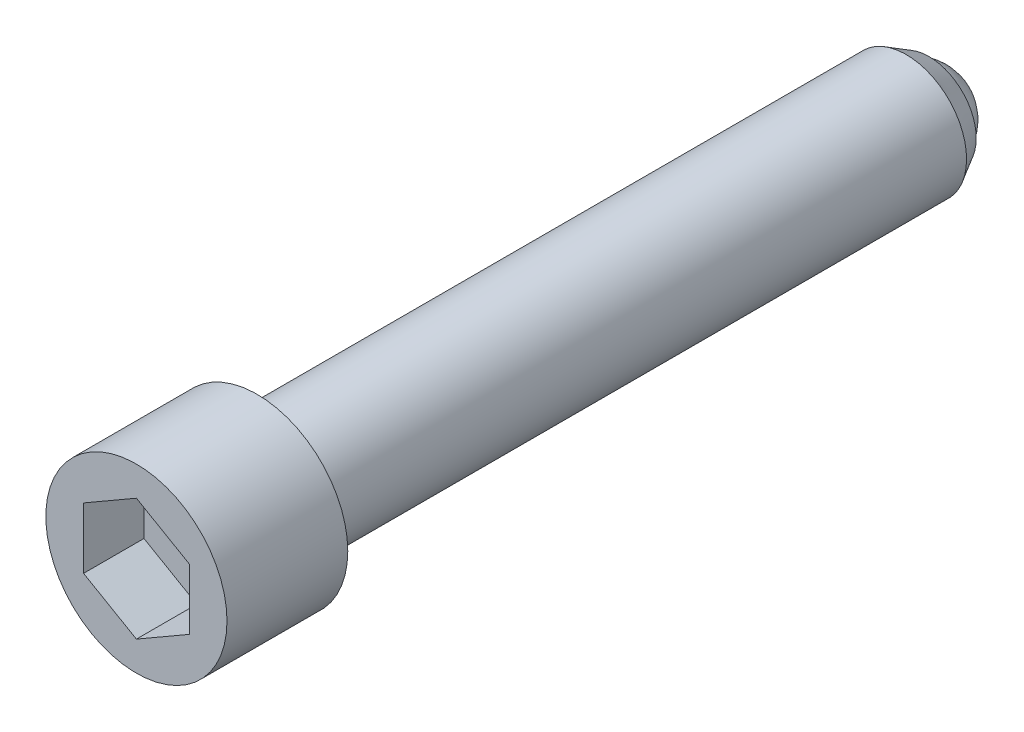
ISO-10303-21;
HEADER;
FILE_DESCRIPTION(('STEP AP214'),'2;1');
FILE_NAME('part.step','',(''),(''),'','','');
FILE_SCHEMA(('AUTOMOTIVE_DESIGN { 1 0 10303 214 1 1 1 1 }'));
ENDSEC;
DATA;
#1=APPLICATION_CONTEXT('core data for automotive mechanical design processes');
#2=APPLICATION_PROTOCOL_DEFINITION('international standard','automotive_design',2000,#1);
#3=PRODUCT_CONTEXT('',#1,'mechanical');
#4=PRODUCT('Part','Part','',(#3));
#5=PRODUCT_RELATED_PRODUCT_CATEGORY('part','',(#4));
#6=PRODUCT_DEFINITION_FORMATION('','',#4);
#7=PRODUCT_DEFINITION_CONTEXT('part definition',#1,'design');
#8=PRODUCT_DEFINITION('design','',#6,#7);
#9=PRODUCT_DEFINITION_SHAPE('','',#8);
#10=(LENGTH_UNIT() NAMED_UNIT(*) SI_UNIT(.MILLI.,.METRE.));
#11=(NAMED_UNIT(*) PLANE_ANGLE_UNIT() SI_UNIT($,.RADIAN.));
#12=(NAMED_UNIT(*) SI_UNIT($,.STERADIAN.) SOLID_ANGLE_UNIT());
#13=UNCERTAINTY_MEASURE_WITH_UNIT(LENGTH_MEASURE(1.E-05),#10,'distance_accuracy_value','');
#14=(GEOMETRIC_REPRESENTATION_CONTEXT(3) GLOBAL_UNCERTAINTY_ASSIGNED_CONTEXT((#13)) GLOBAL_UNIT_ASSIGNED_CONTEXT((#10,
#11,#12)) REPRESENTATION_CONTEXT('',''));
#15=CARTESIAN_POINT('',(0.,0.,0.));
#16=DIRECTION('',(0.,0.,1.));
#17=DIRECTION('',(1.,0.,0.));
#18=AXIS2_PLACEMENT_3D('',#15,#16,#17);
#19=CARTESIAN_POINT('',(0.,0.,6.));
#20=DIRECTION('',(0.,0.,-1.));
#21=DIRECTION('',(1.,0.,0.));
#22=AXIS2_PLACEMENT_3D('',#19,#20,#21);
#23=SPHERICAL_SURFACE('',#22,6.);
#24=CARTESIAN_POINT('',(0.,0.,4.));
#25=DIRECTION('',(0.,0.,-1.));
#26=DIRECTION('',(1.,0.,0.));
#27=AXIS2_PLACEMENT_3D('',#24,#25,#26);
#28=CIRCLE('',#27,5.65685424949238);
#29=CARTESIAN_POINT('',(5.65685424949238,0.,4.));
#30=VERTEX_POINT('',#29);
#31=EDGE_CURVE('E9',#30,#30,#28,.T.);
#32=ORIENTED_EDGE('',*,*,#31,.T.);
#33=EDGE_LOOP('',(#32));
#34=FACE_BOUND('',#33,.T.);
#35=ADVANCED_FACE('F15',(#34),#23,.T.);
#36=CARTESIAN_POINT('',(6.25,0.,4.));
#37=DIRECTION('',(0.,0.,1.));
#38=DIRECTION('',(-1.,0.,0.));
#39=AXIS2_PLACEMENT_3D('',#36,#37,#38);
#40=PLANE('',#39);
#41=ORIENTED_EDGE('',*,*,#31,.F.);
#42=EDGE_LOOP('',(#41));
#43=FACE_BOUND('',#42,.T.);
#44=CARTESIAN_POINT('',(0.,0.,4.));
#45=DIRECTION('',(0.,0.,-1.));
#46=DIRECTION('',(1.,0.,0.));
#47=AXIS2_PLACEMENT_3D('',#44,#45,#46);
#48=CIRCLE('',#47,6.25);
#49=CARTESIAN_POINT('',(6.25,0.,4.));
#50=VERTEX_POINT('',#49);
#51=EDGE_CURVE('E22',#50,#50,#48,.T.);
#52=ORIENTED_EDGE('',*,*,#51,.T.);
#53=EDGE_LOOP('',(#52));
#54=FACE_BOUND('',#53,.T.);
#55=ADVANCED_FACE('F136',(#43,#54),#40,.F.);
#56=CARTESIAN_POINT('',(0.,0.,4.));
#57=DIRECTION('',(0.,0.,1.));
#58=DIRECTION('',(-1.,0.,0.));
#59=AXIS2_PLACEMENT_3D('',#56,#57,#58);
#60=CONICAL_SURFACE('',#59,6.25,0.523598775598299);
#61=CARTESIAN_POINT('',(0.,0.,7.0310889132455));
#62=DIRECTION('',(0.,0.,-1.));
#63=DIRECTION('',(1.,0.,0.));
#64=AXIS2_PLACEMENT_3D('',#61,#62,#63);
#65=CIRCLE('',#64,8.);
#66=CARTESIAN_POINT('',(8.,0.,7.0310889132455));
#67=VERTEX_POINT('',#66);
#68=EDGE_CURVE('E131',#67,#67,#65,.T.);
#69=ORIENTED_EDGE('',*,*,#68,.T.);
#70=EDGE_LOOP('',(#69));
#71=FACE_BOUND('',#70,.T.);
#72=ORIENTED_EDGE('',*,*,#51,.F.);
#73=EDGE_LOOP('',(#72));
#74=FACE_BOUND('',#73,.T.);
#75=ADVANCED_FACE('F138',(#71,#74),#60,.T.);
#76=CARTESIAN_POINT('',(0.,0.,-17.));
#77=DIRECTION('',(0.,0.,-1.));
#78=DIRECTION('',(1.,0.,0.));
#79=AXIS2_PLACEMENT_3D('',#76,#77,#78);
#80=CYLINDRICAL_SURFACE('',#79,8.);
#81=CARTESIAN_POINT('',(0.,0.,93.));
#82=DIRECTION('',(0.,0.,-1.));
#83=DIRECTION('',(1.,0.,0.));
#84=AXIS2_PLACEMENT_3D('',#81,#82,#83);
#85=CIRCLE('',#84,8.);
#86=CARTESIAN_POINT('',(8.,0.,93.));
#87=VERTEX_POINT('',#86);
#88=EDGE_CURVE('E128',#87,#87,#85,.T.);
#89=ORIENTED_EDGE('',*,*,#88,.T.);
#90=EDGE_LOOP('',(#89));
#91=FACE_BOUND('',#90,.T.);
#92=ORIENTED_EDGE('',*,*,#68,.F.);
#93=EDGE_LOOP('',(#92));
#94=FACE_BOUND('',#93,.T.);
#95=ADVANCED_FACE('F140',(#91,#94),#80,.T.);
#96=CARTESIAN_POINT('',(8.,0.,93.));
#97=DIRECTION('',(0.,0.,-1.));
#98=DIRECTION('',(1.,0.,0.));
#99=AXIS2_PLACEMENT_3D('',#96,#97,#98);
#100=PLANE('',#99);
#101=CARTESIAN_POINT('',(0.,0.,93.));
#102=DIRECTION('',(0.,0.,-1.));
#103=DIRECTION('',(1.,0.,0.));
#104=AXIS2_PLACEMENT_3D('',#101,#102,#103);
#105=CIRCLE('',#104,12.);
#106=CARTESIAN_POINT('',(12.,0.,93.));
#107=VERTEX_POINT('',#106);
#108=EDGE_CURVE('E125',#107,#107,#105,.T.);
#109=ORIENTED_EDGE('',*,*,#108,.T.);
#110=EDGE_LOOP('',(#109));
#111=FACE_BOUND('',#110,.T.);
#112=ORIENTED_EDGE('',*,*,#88,.F.);
#113=EDGE_LOOP('',(#112));
#114=FACE_BOUND('',#113,.T.);
#115=ADVANCED_FACE('F148',(#111,#114),#100,.T.);
#116=CARTESIAN_POINT('',(0.,0.,-17.));
#117=DIRECTION('',(0.,0.,-1.));
#118=DIRECTION('',(1.,0.,0.));
#119=AXIS2_PLACEMENT_3D('',#116,#117,#118);
#120=CYLINDRICAL_SURFACE('',#119,12.);
#121=CARTESIAN_POINT('',(0.,0.,109.));
#122=DIRECTION('',(0.,0.,-1.));
#123=DIRECTION('',(1.,0.,0.));
#124=AXIS2_PLACEMENT_3D('',#121,#122,#123);
#125=CIRCLE('',#124,12.);
#126=CARTESIAN_POINT('',(12.,0.,109.));
#127=VERTEX_POINT('',#126);
#128=EDGE_CURVE('E122',#127,#127,#125,.T.);
#129=ORIENTED_EDGE('',*,*,#128,.T.);
#130=EDGE_LOOP('',(#129));
#131=FACE_BOUND('',#130,.T.);
#132=ORIENTED_EDGE('',*,*,#108,.F.);
#133=EDGE_LOOP('',(#132));
#134=FACE_BOUND('',#133,.T.);
#135=ADVANCED_FACE('F187',(#131,#134),#120,.T.);
#136=CARTESIAN_POINT('',(12.,0.,109.));
#137=DIRECTION('',(0.,0.,1.));
#138=DIRECTION('',(-1.,0.,0.));
#139=AXIS2_PLACEMENT_3D('',#136,#137,#138);
#140=PLANE('',#139);
#141=DIRECTION('',(-0.86602540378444,0.5,0.));
#142=VECTOR('',#141,1.);
#143=CARTESIAN_POINT('',(7.,4.04145188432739,109.));
#144=LINE('',#143,#142);
#145=CARTESIAN_POINT('',(7.,4.04145188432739,109.));
#146=VERTEX_POINT('',#145);
#147=CARTESIAN_POINT('',(0.,8.08290376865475,109.));
#148=VERTEX_POINT('',#147);
#149=EDGE_CURVE('E29',#146,#148,#144,.T.);
#150=ORIENTED_EDGE('',*,*,#149,.F.);
#151=DIRECTION('',(0.,1.,0.));
#152=VECTOR('',#151,1.);
#153=CARTESIAN_POINT('',(7.,-4.04145188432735,109.));
#154=LINE('',#153,#152);
#155=CARTESIAN_POINT('',(7.,-4.04145188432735,109.));
#156=VERTEX_POINT('',#155);
#157=EDGE_CURVE('E98',#156,#146,#154,.T.);
#158=ORIENTED_EDGE('',*,*,#157,.F.);
#159=DIRECTION('',(-0.866025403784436,-0.5,0.));
#160=VECTOR('',#159,1.);
#161=CARTESIAN_POINT('',(7.,-4.04145188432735,109.));
#162=LINE('',#161,#160);
#163=CARTESIAN_POINT('',(0.,-8.08290376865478,109.));
#164=VERTEX_POINT('',#163);
#165=EDGE_CURVE('E93',#156,#164,#162,.T.);
#166=ORIENTED_EDGE('',*,*,#165,.T.);
#167=DIRECTION('',(0.866025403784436,-0.5,0.));
#168=VECTOR('',#167,1.);
#169=CARTESIAN_POINT('',(-7.,-4.04145188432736,109.));
#170=LINE('',#169,#168);
#171=CARTESIAN_POINT('',(-7.,-4.04145188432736,109.));
#172=VERTEX_POINT('',#171);
#173=EDGE_CURVE('E91',#172,#164,#170,.T.);
#174=ORIENTED_EDGE('',*,*,#173,.F.);
#175=DIRECTION('',(0.,1.,0.));
#176=VECTOR('',#175,1.);
#177=CARTESIAN_POINT('',(-7.,-4.04145188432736,109.));
#178=LINE('',#177,#176);
#179=CARTESIAN_POINT('',(-7.,4.04145188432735,109.));
#180=VERTEX_POINT('',#179);
#181=EDGE_CURVE('E72',#172,#180,#178,.T.);
#182=ORIENTED_EDGE('',*,*,#181,.T.);
#183=DIRECTION('',(0.866025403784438,0.5,0.));
#184=VECTOR('',#183,1.);
#185=CARTESIAN_POINT('',(-7.,4.04145188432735,109.));
#186=LINE('',#185,#184);
#187=EDGE_CURVE('E83',#180,#148,#186,.T.);
#188=ORIENTED_EDGE('',*,*,#187,.T.);
#189=EDGE_LOOP('',(#150,#158,#166,#174,#182,#188));
#190=FACE_BOUND('',#189,.T.);
#191=ORIENTED_EDGE('',*,*,#128,.F.);
#192=EDGE_LOOP('',(#191));
#193=FACE_BOUND('',#192,.T.);
#194=ADVANCED_FACE('F87',(#190,#193),#140,.T.);
#195=CARTESIAN_POINT('',(7.,4.04145188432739,101.));
#196=DIRECTION('',(0.5,0.86602540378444,0.));
#197=DIRECTION('',(0.86602540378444,-0.5,0.));
#198=AXIS2_PLACEMENT_3D('',#195,#196,#197);
#199=PLANE('',#198);
#200=DIRECTION('',(0.,0.,1.));
#201=VECTOR('',#200,1.);
#202=CARTESIAN_POINT('',(7.,4.04145188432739,101.));
#203=LINE('',#202,#201);
#204=CARTESIAN_POINT('',(7.,4.04145188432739,101.));
#205=VERTEX_POINT('',#204);
#206=EDGE_CURVE('E36',#205,#146,#203,.T.);
#207=ORIENTED_EDGE('',*,*,#206,.T.);
#208=ORIENTED_EDGE('',*,*,#149,.T.);
#209=DIRECTION('',(0.,0.,1.));
#210=VECTOR('',#209,1.);
#211=CARTESIAN_POINT('',(0.,8.08290376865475,101.));
#212=LINE('',#211,#210);
#213=CARTESIAN_POINT('',(0.,8.08290376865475,101.));
#214=VERTEX_POINT('',#213);
#215=EDGE_CURVE('E80',#214,#148,#212,.T.);
#216=ORIENTED_EDGE('',*,*,#215,.F.);
#217=DIRECTION('',(-0.86602540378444,0.5,0.));
#218=VECTOR('',#217,1.);
#219=CARTESIAN_POINT('',(7.,4.04145188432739,101.));
#220=LINE('',#219,#218);
#221=EDGE_CURVE('E100',#205,#214,#220,.T.);
#222=ORIENTED_EDGE('',*,*,#221,.F.);
#223=EDGE_LOOP('',(#207,#208,#216,#222));
#224=FACE_BOUND('',#223,.T.);
#225=ADVANCED_FACE('F206',(#224),#199,.F.);
#226=CARTESIAN_POINT('',(7.,-4.04145188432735,101.));
#227=DIRECTION('',(1.,0.,0.));
#228=DIRECTION('',(0.,-1.,0.));
#229=AXIS2_PLACEMENT_3D('',#226,#227,#228);
#230=PLANE('',#229);
#231=DIRECTION('',(0.,0.,1.));
#232=VECTOR('',#231,1.);
#233=CARTESIAN_POINT('',(7.,-4.04145188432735,101.));
#234=LINE('',#233,#232);
#235=CARTESIAN_POINT('',(7.,-4.04145188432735,101.));
#236=VERTEX_POINT('',#235);
#237=EDGE_CURVE('E119',#236,#156,#234,.T.);
#238=ORIENTED_EDGE('',*,*,#237,.T.);
#239=ORIENTED_EDGE('',*,*,#157,.T.);
#240=ORIENTED_EDGE('',*,*,#206,.F.);
#241=DIRECTION('',(0.,1.,0.));
#242=VECTOR('',#241,1.);
#243=CARTESIAN_POINT('',(7.,-4.04145188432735,101.));
#244=LINE('',#243,#242);
#245=EDGE_CURVE('E112',#236,#205,#244,.T.);
#246=ORIENTED_EDGE('',*,*,#245,.F.);
#247=EDGE_LOOP('',(#238,#239,#240,#246));
#248=FACE_BOUND('',#247,.T.);
#249=ADVANCED_FACE('F215',(#248),#230,.F.);
#250=CARTESIAN_POINT('',(7.,-4.04145188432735,101.));
#251=DIRECTION('',(-0.5,0.866025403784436,0.));
#252=DIRECTION('',(0.866025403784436,0.5,0.));
#253=AXIS2_PLACEMENT_3D('',#250,#251,#252);
#254=PLANE('',#253);
#255=DIRECTION('',(0.,0.,1.));
#256=VECTOR('',#255,1.);
#257=CARTESIAN_POINT('',(0.,-8.08290376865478,101.));
#258=LINE('',#257,#256);
#259=CARTESIAN_POINT('',(0.,-8.08290376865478,101.));
#260=VERTEX_POINT('',#259);
#261=EDGE_CURVE('E117',#260,#164,#258,.T.);
#262=ORIENTED_EDGE('',*,*,#261,.T.);
#263=ORIENTED_EDGE('',*,*,#165,.F.);
#264=ORIENTED_EDGE('',*,*,#237,.F.);
#265=DIRECTION('',(-0.866025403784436,-0.5,0.));
#266=VECTOR('',#265,1.);
#267=CARTESIAN_POINT('',(7.,-4.04145188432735,101.));
#268=LINE('',#267,#266);
#269=EDGE_CURVE('E109',#236,#260,#268,.T.);
#270=ORIENTED_EDGE('',*,*,#269,.T.);
#271=EDGE_LOOP('',(#262,#263,#264,#270));
#272=FACE_BOUND('',#271,.T.);
#273=ADVANCED_FACE('F224',(#272),#254,.T.);
#274=CARTESIAN_POINT('',(-7.,-4.04145188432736,101.));
#275=DIRECTION('',(-0.5,-0.866025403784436,0.));
#276=DIRECTION('',(-0.866025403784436,0.5,0.));
#277=AXIS2_PLACEMENT_3D('',#274,#275,#276);
#278=PLANE('',#277);
#279=DIRECTION('',(0.,0.,1.));
#280=VECTOR('',#279,1.);
#281=CARTESIAN_POINT('',(-7.,-4.04145188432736,101.));
#282=LINE('',#281,#280);
#283=CARTESIAN_POINT('',(-7.,-4.04145188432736,101.));
#284=VERTEX_POINT('',#283);
#285=EDGE_CURVE('E79',#284,#172,#282,.T.);
#286=ORIENTED_EDGE('',*,*,#285,.T.);
#287=ORIENTED_EDGE('',*,*,#173,.T.);
#288=ORIENTED_EDGE('',*,*,#261,.F.);
#289=DIRECTION('',(0.866025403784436,-0.5,0.));
#290=VECTOR('',#289,1.);
#291=CARTESIAN_POINT('',(-7.,-4.04145188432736,101.));
#292=LINE('',#291,#290);
#293=EDGE_CURVE('E106',#284,#260,#292,.T.);
#294=ORIENTED_EDGE('',*,*,#293,.F.);
#295=EDGE_LOOP('',(#286,#287,#288,#294));
#296=FACE_BOUND('',#295,.T.);
#297=ADVANCED_FACE('F233',(#296),#278,.F.);
#298=CARTESIAN_POINT('',(-7.,-4.04145188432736,101.));
#299=DIRECTION('',(1.,0.,0.));
#300=DIRECTION('',(0.,-1.,0.));
#301=AXIS2_PLACEMENT_3D('',#298,#299,#300);
#302=PLANE('',#301);
#303=DIRECTION('',(0.,0.,1.));
#304=VECTOR('',#303,1.);
#305=CARTESIAN_POINT('',(-7.,4.04145188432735,101.));
#306=LINE('',#305,#304);
#307=CARTESIAN_POINT('',(-7.,4.04145188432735,101.));
#308=VERTEX_POINT('',#307);
#309=EDGE_CURVE('E68',#308,#180,#306,.T.);
#310=ORIENTED_EDGE('',*,*,#309,.T.);
#311=ORIENTED_EDGE('',*,*,#181,.F.);
#312=ORIENTED_EDGE('',*,*,#285,.F.);
#313=DIRECTION('',(0.,1.,0.));
#314=VECTOR('',#313,1.);
#315=CARTESIAN_POINT('',(-7.,-4.04145188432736,101.));
#316=LINE('',#315,#314);
#317=EDGE_CURVE('E75',#284,#308,#316,.T.);
#318=ORIENTED_EDGE('',*,*,#317,.T.);
#319=EDGE_LOOP('',(#310,#311,#312,#318));
#320=FACE_BOUND('',#319,.T.);
#321=ADVANCED_FACE('F70',(#320),#302,.T.);
#322=CARTESIAN_POINT('',(-7.,4.04145188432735,101.));
#323=DIRECTION('',(0.5,-0.866025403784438,0.));
#324=DIRECTION('',(-0.866025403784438,-0.5,0.));
#325=AXIS2_PLACEMENT_3D('',#322,#323,#324);
#326=PLANE('',#325);
#327=DIRECTION('',(0.866025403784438,0.5,0.));
#328=VECTOR('',#327,1.);
#329=CARTESIAN_POINT('',(-7.,4.04145188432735,101.));
#330=LINE('',#329,#328);
#331=EDGE_CURVE('E103',#308,#214,#330,.T.);
#332=ORIENTED_EDGE('',*,*,#331,.T.);
#333=ORIENTED_EDGE('',*,*,#215,.T.);
#334=ORIENTED_EDGE('',*,*,#187,.F.);
#335=ORIENTED_EDGE('',*,*,#309,.F.);
#336=EDGE_LOOP('',(#332,#333,#334,#335));
#337=FACE_BOUND('',#336,.T.);
#338=ADVANCED_FACE('F84',(#337),#326,.T.);
#339=CARTESIAN_POINT('',(14.,0.,101.));
#340=DIRECTION('',(0.,0.,1.));
#341=DIRECTION('',(-1.,0.,0.));
#342=AXIS2_PLACEMENT_3D('',#339,#340,#341);
#343=PLANE('',#342);
#344=ORIENTED_EDGE('',*,*,#221,.T.);
#345=ORIENTED_EDGE('',*,*,#331,.F.);
#346=ORIENTED_EDGE('',*,*,#317,.F.);
#347=ORIENTED_EDGE('',*,*,#293,.T.);
#348=ORIENTED_EDGE('',*,*,#269,.F.);
#349=ORIENTED_EDGE('',*,*,#245,.T.);
#350=EDGE_LOOP('',(#344,#345,#346,#347,#348,#349));
#351=FACE_BOUND('',#350,.T.);
#352=ADVANCED_FACE('F253',(#351),#343,.T.);
#353=CLOSED_SHELL('',(#35,#55,#75,#95,#115,#135,#194,#225,#249,#273,#297,#321,#338,#352));
#354=MANIFOLD_SOLID_BREP('B1',#353);
#355=ADVANCED_BREP_SHAPE_REPRESENTATION('',(#18,#354),#14);
#356=SHAPE_DEFINITION_REPRESENTATION(#9,#355);
ENDSEC;
END-ISO-10303-21;
